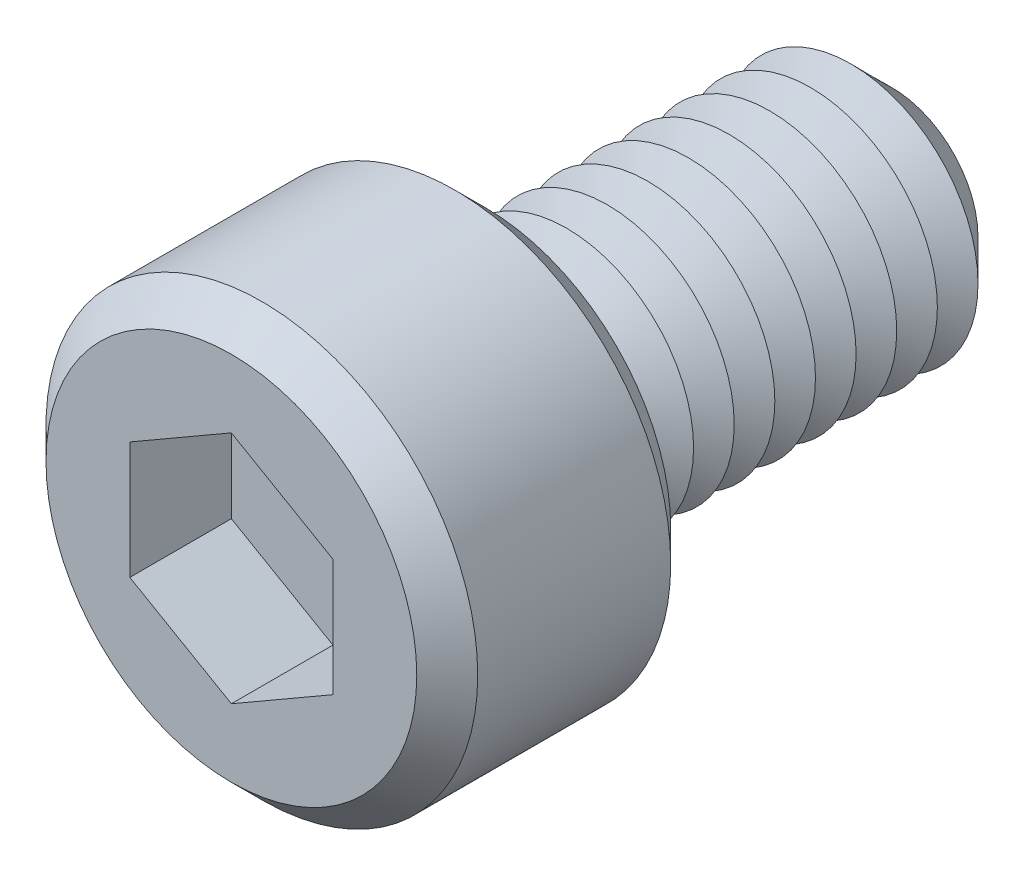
from build123d import *

# Parameters (mm, degrees)
SKETCH1_R           = 4.25
BOSS_EXTRUDE1_DEPTH = 5
SKETCH2_R           = 2.5
BOSS_EXTRUDE2_DEPTH = 8
CHAMFER1_SIZE       = 0.8
LPATTERN1_COUNT     = 9
LPATTERN1_PITCH     = 0.8
CUT_EXTRUDE1_DEPTH  = 2
SKETCH6_R           = 0.65
CUT_EXTRUDE2_DEPTH  = 11
CHAMFER2_SIZE       = 0.6


with BuildPart() as part:
    # Sketch1 → Boss-Extrude1 (new body)
    with BuildSketch(Plane.XY):
        Circle(SKETCH1_R)
    extrude(amount=BOSS_EXTRUDE1_DEPTH)

    # Sketch2 → Boss-Extrude2 (add)
    with BuildSketch(Plane(origin=(0, 0, 0), x_dir=(-1, 0, 0), z_dir=(0, 0, -1))):
        Circle(SKETCH2_R)
    extrude(amount=BOSS_EXTRUDE2_DEPTH)

    # Chamfer1
    chamfer1_edges = [part.edges().sort_by_distance(p)[0] for p in [
        (2.5, 0, -8),
    ]]
    chamfer(chamfer1_edges, length=CHAMFER1_SIZE)

    # Sketch4 → Cut-Revolve1 (revolve, cut)
    with BuildSketch(Plane(origin=(0, 0, 0), x_dir=(0, 0, -1), z_dir=(1, 0, 0)), mode=Mode.PRIVATE) as cut_revolve1_sk:
        Polygon((0, 2.5), (0.4, 1.807179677), (0.8, 2.5), align=None)
    cut_revolve1 = revolve(cut_revolve1_sk.sketch.rotate(Axis((0, 0, 2.512122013), (0, 0, -1)), 90), axis=Axis((0, 0, 2.512122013), (0, 0, -1)), mode=Mode.SUBTRACT)

    # LPattern1: Cut-Revolve1 ×9
    with Locations(*[(0, 0, -i * LPATTERN1_PITCH) for i in range(1, LPATTERN1_COUNT)]):
        add(cut_revolve1, mode=Mode.SUBTRACT)

    # Sketch5 → Cut-Extrude1 (cut)
    with BuildSketch(Plane.XY.offset(5)):
        Polygon((0, 2.309401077), (-2, 1.154700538), (-2, -1.154700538), (0, -2.309401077), (2, -1.154700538), (2, 1.154700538), align=None)
    extrude(amount=-CUT_EXTRUDE1_DEPTH, mode=Mode.SUBTRACT)

    # Sketch6 → Cut-Extrude2 (cut)
    with BuildSketch(Plane.XY.offset(3)):
        Circle(SKETCH6_R)
    extrude(amount=-CUT_EXTRUDE2_DEPTH, mode=Mode.SUBTRACT)

    # Chamfer2
    chamfer2_edges = [part.edges().sort_by_distance(p)[0] for p in [
        (-4.25, 0, 0),
        (-4.25, 0, 5),
    ]]
    chamfer(chamfer2_edges, length=CHAMFER2_SIZE)


solid = part.part
